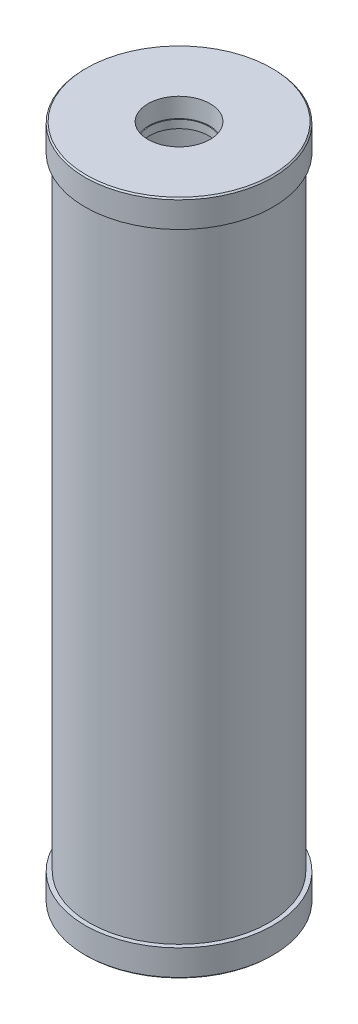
ISO-10303-21;
HEADER;
FILE_DESCRIPTION(('STEP AP214'),'2;1');
FILE_NAME('part.step','',(''),(''),'','','');
FILE_SCHEMA(('AUTOMOTIVE_DESIGN { 1 0 10303 214 1 1 1 1 }'));
ENDSEC;
DATA;
#1=APPLICATION_CONTEXT('core data for automotive mechanical design processes');
#2=APPLICATION_PROTOCOL_DEFINITION('international standard','automotive_design',2000,#1);
#3=PRODUCT_CONTEXT('',#1,'mechanical');
#4=PRODUCT('Part','Part','',(#3));
#5=PRODUCT_RELATED_PRODUCT_CATEGORY('part','',(#4));
#6=PRODUCT_DEFINITION_FORMATION('','',#4);
#7=PRODUCT_DEFINITION_CONTEXT('part definition',#1,'design');
#8=PRODUCT_DEFINITION('design','',#6,#7);
#9=PRODUCT_DEFINITION_SHAPE('','',#8);
#10=(LENGTH_UNIT() NAMED_UNIT(*) SI_UNIT(.MILLI.,.METRE.));
#11=(NAMED_UNIT(*) PLANE_ANGLE_UNIT() SI_UNIT($,.RADIAN.));
#12=(NAMED_UNIT(*) SI_UNIT($,.STERADIAN.) SOLID_ANGLE_UNIT());
#13=UNCERTAINTY_MEASURE_WITH_UNIT(LENGTH_MEASURE(1.E-05),#10,'distance_accuracy_value','');
#14=(GEOMETRIC_REPRESENTATION_CONTEXT(3) GLOBAL_UNCERTAINTY_ASSIGNED_CONTEXT((#13)) GLOBAL_UNIT_ASSIGNED_CONTEXT((#10,
#11,#12)) REPRESENTATION_CONTEXT('',''));
#15=CARTESIAN_POINT('',(0.,0.,0.));
#16=DIRECTION('',(0.,0.,1.));
#17=DIRECTION('',(1.,0.,0.));
#18=AXIS2_PLACEMENT_3D('',#15,#16,#17);
#19=CARTESIAN_POINT('',(0.,25.4,0.));
#20=DIRECTION('',(0.,1.,0.));
#21=DIRECTION('',(0.,0.,1.));
#22=AXIS2_PLACEMENT_3D('',#19,#20,#21);
#23=PLANE('',#22);
#24=CARTESIAN_POINT('',(0.,25.4,0.));
#25=DIRECTION('',(0.,1.,0.));
#26=DIRECTION('',(0.,0.,1.));
#27=AXIS2_PLACEMENT_3D('',#24,#25,#26);
#28=CIRCLE('',#27,27.7876);
#29=CARTESIAN_POINT('',(0.,25.4,27.7876));
#30=VERTEX_POINT('',#29);
#31=EDGE_CURVE('E54',#30,#30,#28,.T.);
#32=ORIENTED_EDGE('',*,*,#31,.F.);
#33=EDGE_LOOP('',(#32));
#34=FACE_BOUND('',#33,.T.);
#35=CARTESIAN_POINT('',(0.,25.4,0.));
#36=DIRECTION('',(0.,1.,0.));
#37=DIRECTION('',(0.,0.,1.));
#38=AXIS2_PLACEMENT_3D('',#35,#36,#37);
#39=CIRCLE('',#38,74.676);
#40=CARTESIAN_POINT('',(0.,25.4,-74.676));
#41=VERTEX_POINT('',#40);
#42=EDGE_CURVE('E68',#41,#41,#39,.T.);
#43=ORIENTED_EDGE('',*,*,#42,.T.);
#44=EDGE_LOOP('',(#43));
#45=FACE_BOUND('',#44,.T.);
#46=ADVANCED_FACE('F33',(#34,#45),#23,.T.);
#47=CARTESIAN_POINT('',(0.,635.,0.));
#48=DIRECTION('',(0.,-1.,0.));
#49=DIRECTION('',(0.,0.,-1.));
#50=AXIS2_PLACEMENT_3D('',#47,#48,#49);
#51=CYLINDRICAL_SURFACE('',#50,74.676);
#52=CARTESIAN_POINT('',(0.,609.6,0.));
#53=DIRECTION('',(0.,1.,0.));
#54=DIRECTION('',(0.,0.,1.));
#55=AXIS2_PLACEMENT_3D('',#52,#53,#54);
#56=CIRCLE('',#55,74.676);
#57=CARTESIAN_POINT('',(0.,609.6,-74.676));
#58=VERTEX_POINT('',#57);
#59=EDGE_CURVE('E64',#58,#58,#56,.T.);
#60=CARTESIAN_POINT('',(0.,25.4,-74.676));
#61=CARTESIAN_POINT('',(0.,31.4854166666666,-74.676));
#62=CARTESIAN_POINT('',(0.,37.5708333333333,-74.676));
#63=CARTESIAN_POINT('',(0.,49.7416666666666,-74.676));
#64=CARTESIAN_POINT('',(0.,55.8270833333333,-74.676));
#65=CARTESIAN_POINT('',(0.,67.9979166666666,-74.676));
#66=CARTESIAN_POINT('',(0.,74.0833333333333,-74.676));
#67=CARTESIAN_POINT('',(0.,86.2541666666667,-74.676));
#68=CARTESIAN_POINT('',(0.,92.3395833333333,-74.676));
#69=CARTESIAN_POINT('',(0.,104.510416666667,-74.676));
#70=CARTESIAN_POINT('',(0.,110.595833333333,-74.676));
#71=CARTESIAN_POINT('',(0.,122.766666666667,-74.676));
#72=CARTESIAN_POINT('',(0.,128.852083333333,-74.676));
#73=CARTESIAN_POINT('',(0.,141.022916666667,-74.676));
#74=CARTESIAN_POINT('',(0.,147.108333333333,-74.676));
#75=CARTESIAN_POINT('',(0.,159.279166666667,-74.676));
#76=CARTESIAN_POINT('',(0.,165.364583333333,-74.676));
#77=CARTESIAN_POINT('',(0.,177.535416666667,-74.676));
#78=CARTESIAN_POINT('',(0.,183.620833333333,-74.676));
#79=CARTESIAN_POINT('',(0.,195.791666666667,-74.676));
#80=CARTESIAN_POINT('',(0.,201.877083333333,-74.676));
#81=CARTESIAN_POINT('',(0.,214.047916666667,-74.676));
#82=CARTESIAN_POINT('',(0.,220.133333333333,-74.676));
#83=CARTESIAN_POINT('',(0.,232.304166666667,-74.676));
#84=CARTESIAN_POINT('',(0.,238.389583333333,-74.676));
#85=CARTESIAN_POINT('',(0.,250.560416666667,-74.676));
#86=CARTESIAN_POINT('',(0.,256.645833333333,-74.676));
#87=CARTESIAN_POINT('',(0.,268.816666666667,-74.676));
#88=CARTESIAN_POINT('',(0.,274.902083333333,-74.676));
#89=CARTESIAN_POINT('',(0.,287.072916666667,-74.676));
#90=CARTESIAN_POINT('',(0.,293.158333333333,-74.676));
#91=CARTESIAN_POINT('',(0.,305.329166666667,-74.676));
#92=CARTESIAN_POINT('',(0.,311.414583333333,-74.676));
#93=CARTESIAN_POINT('',(0.,323.585416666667,-74.676));
#94=CARTESIAN_POINT('',(0.,329.670833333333,-74.676));
#95=CARTESIAN_POINT('',(0.,341.841666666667,-74.676));
#96=CARTESIAN_POINT('',(0.,347.927083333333,-74.676));
#97=CARTESIAN_POINT('',(0.,360.097916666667,-74.676));
#98=CARTESIAN_POINT('',(0.,366.183333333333,-74.676));
#99=CARTESIAN_POINT('',(0.,378.354166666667,-74.676));
#100=CARTESIAN_POINT('',(0.,384.439583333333,-74.676));
#101=CARTESIAN_POINT('',(0.,396.610416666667,-74.676));
#102=CARTESIAN_POINT('',(0.,402.695833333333,-74.676));
#103=CARTESIAN_POINT('',(0.,414.866666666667,-74.676));
#104=CARTESIAN_POINT('',(0.,420.952083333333,-74.676));
#105=CARTESIAN_POINT('',(0.,433.122916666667,-74.676));
#106=CARTESIAN_POINT('',(0.,439.208333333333,-74.676));
#107=CARTESIAN_POINT('',(0.,451.379166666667,-74.676));
#108=CARTESIAN_POINT('',(0.,457.464583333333,-74.676));
#109=CARTESIAN_POINT('',(0.,469.635416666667,-74.676));
#110=CARTESIAN_POINT('',(0.,475.720833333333,-74.676));
#111=CARTESIAN_POINT('',(0.,487.891666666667,-74.676));
#112=CARTESIAN_POINT('',(0.,493.977083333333,-74.676));
#113=CARTESIAN_POINT('',(0.,506.147916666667,-74.676));
#114=CARTESIAN_POINT('',(0.,512.233333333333,-74.676));
#115=CARTESIAN_POINT('',(0.,524.404166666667,-74.676));
#116=CARTESIAN_POINT('',(0.,530.489583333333,-74.676));
#117=CARTESIAN_POINT('',(0.,542.660416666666,-74.676));
#118=CARTESIAN_POINT('',(0.,548.745833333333,-74.676));
#119=CARTESIAN_POINT('',(0.,560.916666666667,-74.676));
#120=CARTESIAN_POINT('',(0.,567.002083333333,-74.676));
#121=CARTESIAN_POINT('',(0.,579.172916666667,-74.676));
#122=CARTESIAN_POINT('',(0.,585.258333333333,-74.676));
#123=CARTESIAN_POINT('',(0.,597.429166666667,-74.676));
#124=CARTESIAN_POINT('',(0.,603.514583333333,-74.676));
#125=CARTESIAN_POINT('',(0.,609.6,-74.676));
#126=B_SPLINE_CURVE_WITH_KNOTS('',3,(#60,#61,#62,#63,#64,#65,#66,#67,#68,#69,#70,#71,#72,#73,
#74,#75,#76,#77,#78,#79,#80,#81,#82,#83,#84,#85,#86,#87,#88,#89,#90,#91,#92,#93,#94,#95,#96,#97,
#98,#99,#100,#101,#102,#103,#104,#105,#106,#107,#108,#109,#110,#111,#112,#113,#114,#115,#116,
#117,#118,#119,#120,#121,#122,#123,#124,#125),.UNSPECIFIED.,.F.,.F.,(4,2,2,2,2,2,2,2,2,2,2,2,2,
2,2,2,2,2,2,2,2,2,2,2,2,2,2,2,2,2,2,2,4),(0.,18.25625,36.5124999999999,54.76875,73.025,91.28125,
109.5375,127.79375,146.05,164.30625,182.5625,200.81875,219.075,237.33125,255.5875,273.84375,
292.1,310.35625,328.6125,346.86875,365.125,383.38125,401.6375,419.89375,438.15,456.40625,
474.6625,492.91875,511.175,529.43125,547.6875,565.94375,584.2),.UNSPECIFIED.);
#127=EDGE_CURVE('BSEAM119',#41,#58,#126,.T.);
#128=ORIENTED_EDGE('',*,*,#42,.F.);
#129=ORIENTED_EDGE('',*,*,#59,.T.);
#130=ORIENTED_EDGE('',*,*,#127,.T.);
#131=ORIENTED_EDGE('',*,*,#127,.F.);
#132=EDGE_LOOP('',(#128,#130,#129,#131));
#133=FACE_BOUND('',#132,.T.);
#134=ADVANCED_FACE('F119',(#133),#51,.F.);
#135=CARTESIAN_POINT('',(0.,609.6,0.));
#136=DIRECTION('',(0.,1.,0.));
#137=DIRECTION('',(0.,0.,1.));
#138=AXIS2_PLACEMENT_3D('',#135,#136,#137);
#139=PLANE('',#138);
#140=CARTESIAN_POINT('',(0.,609.6,0.));
#141=DIRECTION('',(0.,1.,0.));
#142=DIRECTION('',(0.,0.,1.));
#143=AXIS2_PLACEMENT_3D('',#140,#141,#142);
#144=CIRCLE('',#143,27.7876);
#145=CARTESIAN_POINT('',(0.,609.6,27.7876));
#146=VERTEX_POINT('',#145);
#147=EDGE_CURVE('E59',#146,#146,#144,.T.);
#148=ORIENTED_EDGE('',*,*,#147,.T.);
#149=EDGE_LOOP('',(#148));
#150=FACE_BOUND('',#149,.T.);
#151=ORIENTED_EDGE('',*,*,#59,.F.);
#152=EDGE_LOOP('',(#151));
#153=FACE_BOUND('',#152,.T.);
#154=ADVANCED_FACE('F112',(#150,#153),#139,.F.);
#155=CARTESIAN_POINT('',(0.,635.,0.));
#156=DIRECTION('',(0.,1.,0.));
#157=DIRECTION('',(0.,0.,1.));
#158=AXIS2_PLACEMENT_3D('',#155,#156,#157);
#159=CYLINDRICAL_SURFACE('',#158,27.7876);
#160=CARTESIAN_POINT('',(0.,617.22,0.));
#161=DIRECTION('',(0.,1.,0.));
#162=DIRECTION('',(0.,0.,1.));
#163=AXIS2_PLACEMENT_3D('',#160,#161,#162);
#164=CIRCLE('',#163,27.7876);
#165=CARTESIAN_POINT('',(0.,617.22,27.7876));
#166=VERTEX_POINT('',#165);
#167=EDGE_CURVE('E63',#166,#166,#164,.T.);
#168=ORIENTED_EDGE('',*,*,#167,.T.);
#169=EDGE_LOOP('',(#168));
#170=FACE_BOUND('',#169,.T.);
#171=ORIENTED_EDGE('',*,*,#147,.F.);
#172=EDGE_LOOP('',(#171));
#173=FACE_BOUND('',#172,.T.);
#174=ADVANCED_FACE('F180',(#170,#173),#159,.F.);
#175=CARTESIAN_POINT('',(27.7876,617.22,0.));
#176=DIRECTION('',(0.,-1.,0.));
#177=DIRECTION('',(0.,0.,-1.));
#178=AXIS2_PLACEMENT_3D('',#175,#176,#177);
#179=PLANE('',#178);
#180=ORIENTED_EDGE('',*,*,#167,.F.);
#181=EDGE_LOOP('',(#180));
#182=FACE_BOUND('',#181,.T.);
#183=CARTESIAN_POINT('',(0.,617.22,0.));
#184=DIRECTION('',(0.,1.,0.));
#185=DIRECTION('',(0.,0.,1.));
#186=AXIS2_PLACEMENT_3D('',#183,#184,#185);
#187=CIRCLE('',#186,28.6326341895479);
#188=CARTESIAN_POINT('',(0.,617.22,28.6326341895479));
#189=VERTEX_POINT('',#188);
#190=EDGE_CURVE('E82',#189,#189,#187,.T.);
#191=ORIENTED_EDGE('',*,*,#190,.T.);
#192=EDGE_LOOP('',(#191));
#193=FACE_BOUND('',#192,.T.);
#194=ADVANCED_FACE('F149',(#182,#193),#179,.F.);
#195=CARTESIAN_POINT('',(0.,635.,0.));
#196=DIRECTION('',(0.,1.,0.));
#197=DIRECTION('',(0.,0.,1.));
#198=AXIS2_PLACEMENT_3D('',#195,#196,#197);
#199=CONICAL_SURFACE('',#198,29.1649912,0.0299323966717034);
#200=ORIENTED_EDGE('',*,*,#190,.F.);
#201=EDGE_LOOP('',(#200));
#202=FACE_BOUND('',#201,.T.);
#203=CARTESIAN_POINT('',(0.,635.,0.));
#204=DIRECTION('',(0.,1.,0.));
#205=DIRECTION('',(0.,0.,1.));
#206=AXIS2_PLACEMENT_3D('',#203,#204,#205);
#207=CIRCLE('',#206,29.1649912);
#208=CARTESIAN_POINT('',(0.,635.,29.1649912));
#209=VERTEX_POINT('',#208);
#210=EDGE_CURVE('E57',#209,#209,#207,.T.);
#211=ORIENTED_EDGE('',*,*,#210,.T.);
#212=EDGE_LOOP('',(#211));
#213=FACE_BOUND('',#212,.T.);
#214=ADVANCED_FACE('F137',(#202,#213),#199,.F.);
#215=CARTESIAN_POINT('',(0.,635.,0.));
#216=DIRECTION('',(0.,-1.,0.));
#217=DIRECTION('',(0.,0.,-1.));
#218=AXIS2_PLACEMENT_3D('',#215,#216,#217);
#219=CYLINDRICAL_SURFACE('',#218,84.201);
#220=CARTESIAN_POINT('',(0.,25.4,0.));
#221=DIRECTION('',(0.,1.,0.));
#222=DIRECTION('',(0.,0.,1.));
#223=AXIS2_PLACEMENT_3D('',#220,#221,#222);
#224=CIRCLE('',#223,84.201);
#225=CARTESIAN_POINT('',(0.,25.4,-84.201));
#226=VERTEX_POINT('',#225);
#227=EDGE_CURVE('E71',#226,#226,#224,.T.);
#228=CARTESIAN_POINT('',(0.,609.6,0.));
#229=DIRECTION('',(0.,1.,0.));
#230=DIRECTION('',(0.,0.,1.));
#231=AXIS2_PLACEMENT_3D('',#228,#229,#230);
#232=CIRCLE('',#231,84.201);
#233=CARTESIAN_POINT('',(0.,609.6,-84.201));
#234=VERTEX_POINT('',#233);
#235=EDGE_CURVE('E53',#234,#234,#232,.T.);
#236=CARTESIAN_POINT('',(0.,25.4,-84.201));
#237=CARTESIAN_POINT('',(0.,31.4854166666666,-84.201));
#238=CARTESIAN_POINT('',(0.,37.5708333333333,-84.201));
#239=CARTESIAN_POINT('',(0.,49.7416666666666,-84.201));
#240=CARTESIAN_POINT('',(0.,55.8270833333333,-84.201));
#241=CARTESIAN_POINT('',(0.,67.9979166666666,-84.201));
#242=CARTESIAN_POINT('',(0.,74.0833333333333,-84.201));
#243=CARTESIAN_POINT('',(0.,86.2541666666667,-84.201));
#244=CARTESIAN_POINT('',(0.,92.3395833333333,-84.201));
#245=CARTESIAN_POINT('',(0.,104.510416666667,-84.201));
#246=CARTESIAN_POINT('',(0.,110.595833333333,-84.201));
#247=CARTESIAN_POINT('',(0.,122.766666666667,-84.201));
#248=CARTESIAN_POINT('',(0.,128.852083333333,-84.201));
#249=CARTESIAN_POINT('',(0.,141.022916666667,-84.201));
#250=CARTESIAN_POINT('',(0.,147.108333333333,-84.201));
#251=CARTESIAN_POINT('',(0.,159.279166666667,-84.201));
#252=CARTESIAN_POINT('',(0.,165.364583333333,-84.201));
#253=CARTESIAN_POINT('',(0.,177.535416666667,-84.201));
#254=CARTESIAN_POINT('',(0.,183.620833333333,-84.201));
#255=CARTESIAN_POINT('',(0.,195.791666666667,-84.201));
#256=CARTESIAN_POINT('',(0.,201.877083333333,-84.201));
#257=CARTESIAN_POINT('',(0.,214.047916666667,-84.201));
#258=CARTESIAN_POINT('',(0.,220.133333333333,-84.201));
#259=CARTESIAN_POINT('',(0.,232.304166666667,-84.201));
#260=CARTESIAN_POINT('',(0.,238.389583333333,-84.201));
#261=CARTESIAN_POINT('',(0.,250.560416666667,-84.201));
#262=CARTESIAN_POINT('',(0.,256.645833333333,-84.201));
#263=CARTESIAN_POINT('',(0.,268.816666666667,-84.201));
#264=CARTESIAN_POINT('',(0.,274.902083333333,-84.201));
#265=CARTESIAN_POINT('',(0.,287.072916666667,-84.201));
#266=CARTESIAN_POINT('',(0.,293.158333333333,-84.201));
#267=CARTESIAN_POINT('',(0.,305.329166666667,-84.201));
#268=CARTESIAN_POINT('',(0.,311.414583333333,-84.201));
#269=CARTESIAN_POINT('',(0.,323.585416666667,-84.201));
#270=CARTESIAN_POINT('',(0.,329.670833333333,-84.201));
#271=CARTESIAN_POINT('',(0.,341.841666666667,-84.201));
#272=CARTESIAN_POINT('',(0.,347.927083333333,-84.201));
#273=CARTESIAN_POINT('',(0.,360.097916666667,-84.201));
#274=CARTESIAN_POINT('',(0.,366.183333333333,-84.201));
#275=CARTESIAN_POINT('',(0.,378.354166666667,-84.201));
#276=CARTESIAN_POINT('',(0.,384.439583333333,-84.201));
#277=CARTESIAN_POINT('',(0.,396.610416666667,-84.201));
#278=CARTESIAN_POINT('',(0.,402.695833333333,-84.201));
#279=CARTESIAN_POINT('',(0.,414.866666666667,-84.201));
#280=CARTESIAN_POINT('',(0.,420.952083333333,-84.201));
#281=CARTESIAN_POINT('',(0.,433.122916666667,-84.201));
#282=CARTESIAN_POINT('',(0.,439.208333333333,-84.201));
#283=CARTESIAN_POINT('',(0.,451.379166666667,-84.201));
#284=CARTESIAN_POINT('',(0.,457.464583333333,-84.201));
#285=CARTESIAN_POINT('',(0.,469.635416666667,-84.201));
#286=CARTESIAN_POINT('',(0.,475.720833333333,-84.201));
#287=CARTESIAN_POINT('',(0.,487.891666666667,-84.201));
#288=CARTESIAN_POINT('',(0.,493.977083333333,-84.201));
#289=CARTESIAN_POINT('',(0.,506.147916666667,-84.201));
#290=CARTESIAN_POINT('',(0.,512.233333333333,-84.201));
#291=CARTESIAN_POINT('',(0.,524.404166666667,-84.201));
#292=CARTESIAN_POINT('',(0.,530.489583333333,-84.201));
#293=CARTESIAN_POINT('',(0.,542.660416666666,-84.201));
#294=CARTESIAN_POINT('',(0.,548.745833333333,-84.201));
#295=CARTESIAN_POINT('',(0.,560.916666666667,-84.201));
#296=CARTESIAN_POINT('',(0.,567.002083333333,-84.201));
#297=CARTESIAN_POINT('',(0.,579.172916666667,-84.201));
#298=CARTESIAN_POINT('',(0.,585.258333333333,-84.201));
#299=CARTESIAN_POINT('',(0.,597.429166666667,-84.201));
#300=CARTESIAN_POINT('',(0.,603.514583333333,-84.201));
#301=CARTESIAN_POINT('',(0.,609.6,-84.201));
#302=B_SPLINE_CURVE_WITH_KNOTS('',3,(#236,#237,#238,#239,#240,#241,#242,#243,#244,#245,#246,
#247,#248,#249,#250,#251,#252,#253,#254,#255,#256,#257,#258,#259,#260,#261,#262,#263,#264,#265,
#266,#267,#268,#269,#270,#271,#272,#273,#274,#275,#276,#277,#278,#279,#280,#281,#282,#283,#284,
#285,#286,#287,#288,#289,#290,#291,#292,#293,#294,#295,#296,#297,#298,#299,#300,#301),
.UNSPECIFIED.,.F.,.F.,(4,2,2,2,2,2,2,2,2,2,2,2,2,2,2,2,2,2,2,2,2,2,2,2,2,2,2,2,2,2,2,2,4),(0.,
18.25625,36.5124999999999,54.76875,73.025,91.28125,109.5375,127.79375,146.05,164.30625,182.5625,
200.81875,219.075,237.33125,255.5875,273.84375,292.1,310.35625,328.6125,346.86875,365.125,
383.38125,401.6375,419.89375,438.15,456.40625,474.6625,492.91875,511.175,529.43125,547.6875,
565.94375,584.2),.UNSPECIFIED.);
#303=EDGE_CURVE('BSEAM131',#226,#234,#302,.T.);
#304=ORIENTED_EDGE('',*,*,#227,.T.);
#305=ORIENTED_EDGE('',*,*,#235,.F.);
#306=ORIENTED_EDGE('',*,*,#303,.T.);
#307=ORIENTED_EDGE('',*,*,#303,.F.);
#308=EDGE_LOOP('',(#304,#306,#305,#307));
#309=FACE_BOUND('',#308,.T.);
#310=ADVANCED_FACE('F131',(#309),#219,.T.);
#311=CARTESIAN_POINT('',(0.,25.4,0.));
#312=DIRECTION('',(0.,1.,0.));
#313=DIRECTION('',(0.,0.,1.));
#314=AXIS2_PLACEMENT_3D('',#311,#312,#313);
#315=CIRCLE('',#314,88.265);
#316=CARTESIAN_POINT('',(0.,25.4,88.265));
#317=VERTEX_POINT('',#316);
#318=EDGE_CURVE('E67',#317,#317,#315,.T.);
#319=ORIENTED_EDGE('',*,*,#318,.T.);
#320=EDGE_LOOP('',(#319));
#321=FACE_BOUND('',#320,.T.);
#322=ORIENTED_EDGE('',*,*,#227,.F.);
#323=EDGE_LOOP('',(#322));
#324=FACE_BOUND('',#323,.T.);
#325=ADVANCED_FACE('F113',(#321,#324),#23,.T.);
#326=CARTESIAN_POINT('',(0.,25.4,0.));
#327=DIRECTION('',(0.,-1.,0.));
#328=DIRECTION('',(0.,0.,-1.));
#329=AXIS2_PLACEMENT_3D('',#326,#327,#328);
#330=CYLINDRICAL_SURFACE('',#329,88.265);
#331=CARTESIAN_POINT('',(0.,1.27000000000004,0.));
#332=DIRECTION('',(0.,1.,0.));
#333=DIRECTION('',(0.,0.,1.));
#334=AXIS2_PLACEMENT_3D('',#331,#332,#333);
#335=CIRCLE('',#334,88.265);
#336=CARTESIAN_POINT('',(0.,1.27000000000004,88.265));
#337=VERTEX_POINT('',#336);
#338=EDGE_CURVE('E48',#337,#337,#335,.T.);
#339=ORIENTED_EDGE('',*,*,#338,.T.);
#340=EDGE_LOOP('',(#339));
#341=FACE_BOUND('',#340,.T.);
#342=ORIENTED_EDGE('',*,*,#318,.F.);
#343=EDGE_LOOP('',(#342));
#344=FACE_BOUND('',#343,.T.);
#345=ADVANCED_FACE('F101',(#341,#344),#330,.T.);
#346=CARTESIAN_POINT('',(0.,0.,0.));
#347=DIRECTION('',(0.,1.,0.));
#348=DIRECTION('',(0.,0.,1.));
#349=AXIS2_PLACEMENT_3D('',#346,#347,#348);
#350=PLANE('',#349);
#351=CARTESIAN_POINT('',(0.,0.,0.));
#352=DIRECTION('',(0.,1.,0.));
#353=DIRECTION('',(0.,0.,1.));
#354=AXIS2_PLACEMENT_3D('',#351,#352,#353);
#355=CIRCLE('',#354,86.995);
#356=CARTESIAN_POINT('',(0.,0.,86.995));
#357=VERTEX_POINT('',#356);
#358=EDGE_CURVE('E44',#357,#357,#355,.F.);
#359=ORIENTED_EDGE('',*,*,#358,.T.);
#360=EDGE_LOOP('',(#359));
#361=FACE_BOUND('',#360,.T.);
#362=CARTESIAN_POINT('',(0.,0.,0.));
#363=DIRECTION('',(0.,-1.,0.));
#364=DIRECTION('',(0.,0.,-1.));
#365=AXIS2_PLACEMENT_3D('',#362,#363,#364);
#366=CIRCLE('',#365,29.1649912);
#367=CARTESIAN_POINT('',(0.,0.,-29.1649912));
#368=VERTEX_POINT('',#367);
#369=EDGE_CURVE('E92',#368,#368,#366,.T.);
#370=ORIENTED_EDGE('',*,*,#369,.F.);
#371=EDGE_LOOP('',(#370));
#372=FACE_BOUND('',#371,.T.);
#373=ADVANCED_FACE('F98',(#361,#372),#350,.F.);
#374=CARTESIAN_POINT('',(0.,609.6,0.));
#375=DIRECTION('',(0.,1.,0.));
#376=DIRECTION('',(0.,0.,1.));
#377=AXIS2_PLACEMENT_3D('',#374,#375,#376);
#378=CIRCLE('',#377,88.265);
#379=CARTESIAN_POINT('',(0.,609.6,88.265));
#380=VERTEX_POINT('',#379);
#381=EDGE_CURVE('E62',#380,#380,#378,.T.);
#382=ORIENTED_EDGE('',*,*,#381,.F.);
#383=EDGE_LOOP('',(#382));
#384=FACE_BOUND('',#383,.T.);
#385=ORIENTED_EDGE('',*,*,#235,.T.);
#386=EDGE_LOOP('',(#385));
#387=FACE_BOUND('',#386,.T.);
#388=ADVANCED_FACE('F100',(#384,#387),#139,.F.);
#389=CARTESIAN_POINT('',(0.,609.6,0.));
#390=DIRECTION('',(0.,1.,0.));
#391=DIRECTION('',(0.,0.,1.));
#392=AXIS2_PLACEMENT_3D('',#389,#390,#391);
#393=CYLINDRICAL_SURFACE('',#392,88.265);
#394=CARTESIAN_POINT('',(0.,633.73,0.));
#395=DIRECTION('',(0.,1.,0.));
#396=DIRECTION('',(0.,0.,1.));
#397=AXIS2_PLACEMENT_3D('',#394,#395,#396);
#398=CIRCLE('',#397,88.265);
#399=CARTESIAN_POINT('',(0.,633.73,88.265));
#400=VERTEX_POINT('',#399);
#401=EDGE_CURVE('E10',#400,#400,#398,.F.);
#402=ORIENTED_EDGE('',*,*,#401,.T.);
#403=EDGE_LOOP('',(#402));
#404=FACE_BOUND('',#403,.T.);
#405=ORIENTED_EDGE('',*,*,#381,.T.);
#406=EDGE_LOOP('',(#405));
#407=FACE_BOUND('',#406,.T.);
#408=ADVANCED_FACE('F109',(#404,#407),#393,.T.);
#409=CARTESIAN_POINT('',(0.,635.,0.));
#410=DIRECTION('',(0.,1.,0.));
#411=DIRECTION('',(0.,0.,1.));
#412=AXIS2_PLACEMENT_3D('',#409,#410,#411);
#413=PLANE('',#412);
#414=CARTESIAN_POINT('',(0.,635.,0.));
#415=DIRECTION('',(0.,1.,0.));
#416=DIRECTION('',(0.,0.,1.));
#417=AXIS2_PLACEMENT_3D('',#414,#415,#416);
#418=CIRCLE('',#417,86.995);
#419=CARTESIAN_POINT('',(0.,635.,86.995));
#420=VERTEX_POINT('',#419);
#421=EDGE_CURVE('E40',#420,#420,#418,.T.);
#422=ORIENTED_EDGE('',*,*,#421,.T.);
#423=EDGE_LOOP('',(#422));
#424=FACE_BOUND('',#423,.T.);
#425=ORIENTED_EDGE('',*,*,#210,.F.);
#426=EDGE_LOOP('',(#425));
#427=FACE_BOUND('',#426,.T.);
#428=ADVANCED_FACE('F175',(#424,#427),#413,.T.);
#429=CARTESIAN_POINT('',(0.,0.,0.));
#430=DIRECTION('',(0.,-1.,0.));
#431=DIRECTION('',(0.,0.,-1.));
#432=AXIS2_PLACEMENT_3D('',#429,#430,#431);
#433=CYLINDRICAL_SURFACE('',#432,27.7876);
#434=ORIENTED_EDGE('',*,*,#31,.T.);
#435=EDGE_LOOP('',(#434));
#436=FACE_BOUND('',#435,.T.);
#437=CARTESIAN_POINT('',(0.,17.78,0.));
#438=DIRECTION('',(0.,-1.,0.));
#439=DIRECTION('',(0.,0.,-1.));
#440=AXIS2_PLACEMENT_3D('',#437,#438,#439);
#441=CIRCLE('',#440,27.7876);
#442=CARTESIAN_POINT('',(0.,17.78,-27.7876));
#443=VERTEX_POINT('',#442);
#444=EDGE_CURVE('E58',#443,#443,#441,.T.);
#445=ORIENTED_EDGE('',*,*,#444,.T.);
#446=EDGE_LOOP('',(#445));
#447=FACE_BOUND('',#446,.T.);
#448=ADVANCED_FACE('F169',(#436,#447),#433,.F.);
#449=CARTESIAN_POINT('',(27.7876,17.78,0.));
#450=DIRECTION('',(0.,1.,0.));
#451=DIRECTION('',(0.,0.,1.));
#452=AXIS2_PLACEMENT_3D('',#449,#450,#451);
#453=PLANE('',#452);
#454=ORIENTED_EDGE('',*,*,#444,.F.);
#455=EDGE_LOOP('',(#454));
#456=FACE_BOUND('',#455,.T.);
#457=CARTESIAN_POINT('',(0.,17.78,0.));
#458=DIRECTION('',(0.,-1.,0.));
#459=DIRECTION('',(0.,0.,-1.));
#460=AXIS2_PLACEMENT_3D('',#457,#458,#459);
#461=CIRCLE('',#460,28.6326341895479);
#462=CARTESIAN_POINT('',(0.,17.78,-28.6326341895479));
#463=VERTEX_POINT('',#462);
#464=EDGE_CURVE('E89',#463,#463,#461,.T.);
#465=ORIENTED_EDGE('',*,*,#464,.T.);
#466=EDGE_LOOP('',(#465));
#467=FACE_BOUND('',#466,.T.);
#468=ADVANCED_FACE('F160',(#456,#467),#453,.F.);
#469=CARTESIAN_POINT('',(0.,0.,0.));
#470=DIRECTION('',(0.,-1.,0.));
#471=DIRECTION('',(0.,0.,-1.));
#472=AXIS2_PLACEMENT_3D('',#469,#470,#471);
#473=CONICAL_SURFACE('',#472,29.1649912,0.0299323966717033);
#474=ORIENTED_EDGE('',*,*,#464,.F.);
#475=EDGE_LOOP('',(#474));
#476=FACE_BOUND('',#475,.T.);
#477=ORIENTED_EDGE('',*,*,#369,.T.);
#478=EDGE_LOOP('',(#477));
#479=FACE_BOUND('',#478,.T.);
#480=ADVANCED_FACE('F96',(#476,#479),#473,.F.);
#481=CARTESIAN_POINT('',(0.,1.27000000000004,0.));
#482=DIRECTION('',(0.,1.,0.));
#483=DIRECTION('',(0.,0.,1.));
#484=AXIS2_PLACEMENT_3D('',#481,#482,#483);
#485=CONICAL_SURFACE('',#484,88.265,0.785398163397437);
#486=ORIENTED_EDGE('',*,*,#358,.F.);
#487=EDGE_LOOP('',(#486));
#488=FACE_BOUND('',#487,.T.);
#489=ORIENTED_EDGE('',*,*,#338,.F.);
#490=EDGE_LOOP('',(#489));
#491=FACE_BOUND('',#490,.T.);
#492=ADVANCED_FACE('F152',(#488,#491),#485,.T.);
#493=CARTESIAN_POINT('',(0.,635.,0.));
#494=DIRECTION('',(0.,-1.,0.));
#495=DIRECTION('',(0.,0.,-1.));
#496=AXIS2_PLACEMENT_3D('',#493,#494,#495);
#497=CONICAL_SURFACE('',#496,86.995,0.785398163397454);
#498=ORIENTED_EDGE('',*,*,#401,.F.);
#499=EDGE_LOOP('',(#498));
#500=FACE_BOUND('',#499,.T.);
#501=ORIENTED_EDGE('',*,*,#421,.F.);
#502=EDGE_LOOP('',(#501));
#503=FACE_BOUND('',#502,.T.);
#504=ADVANCED_FACE('F35',(#500,#503),#497,.T.);
#505=CLOSED_SHELL('',(#46,#134,#154,#174,#194,#214,#310,#325,#345,#373,#388,#408,#428,#448,#468,
#480,#492,#504));
#506=MANIFOLD_SOLID_BREP('B2',#505);
#507=ADVANCED_BREP_SHAPE_REPRESENTATION('',(#18,#506),#14);
#508=SHAPE_DEFINITION_REPRESENTATION(#9,#507);
ENDSEC;
END-ISO-10303-21;
